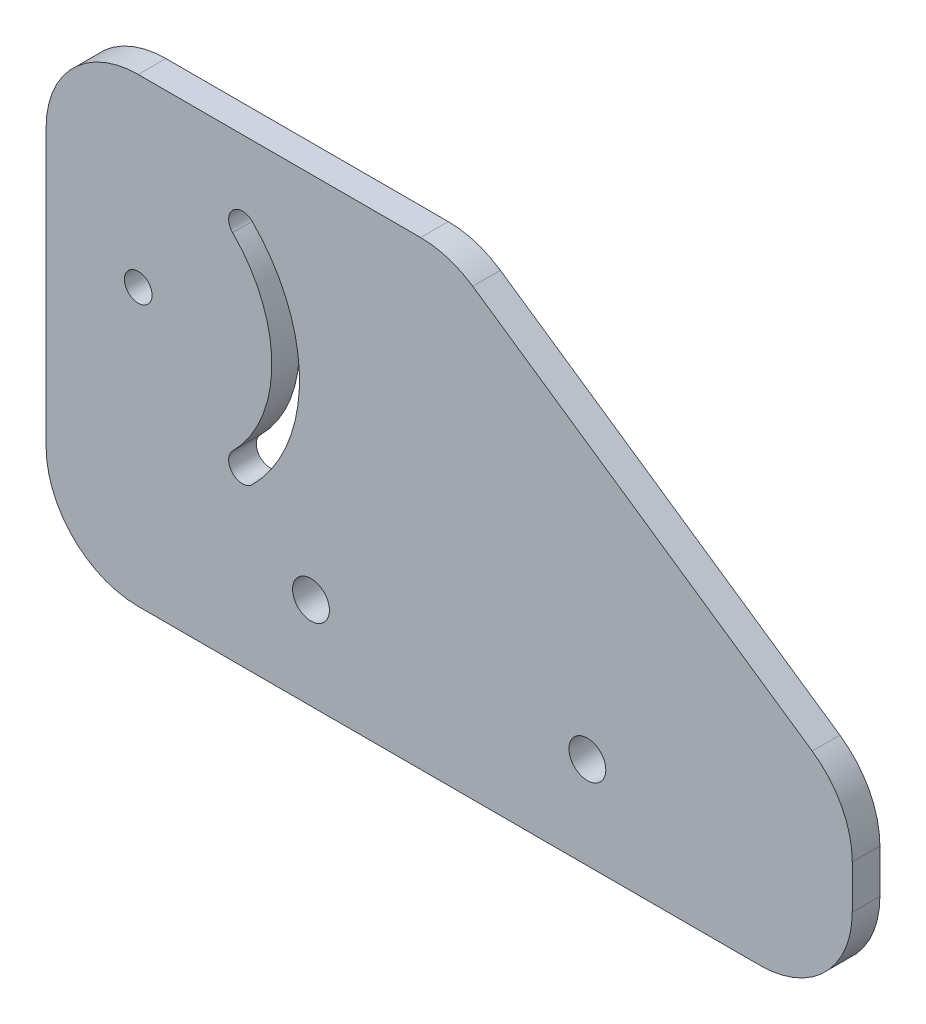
from build123d import *

# Parameters (mm, degrees)
SKETCH_1_W            = 87.5
SKETCH_1_H            = 50
EXTRUDE_1_DEPTH       = 3
HOLE_WIZARD_4_0_4_1_D = 4
CUT_EXTRUDE_2_DEPTH   = 10
SKETCH_6_R            = 1.5
CUT_EXTRUDE_3_DEPTH   = 24
FILLET_1_R            = 10


with BuildPart() as part:
    # Sketch 1 → Extrude 1 (new body)
    with BuildSketch(Plane.XY):
        Rectangle(SKETCH_1_W, SKETCH_1_H)
    extrude(amount=EXTRUDE_1_DEPTH)

    # Hole Wizard 4.0 _4_ _1 (through all)
    with Locations(Plane.XY.offset(3)):
        with Locations((-15, -15), (15, -15)):
            Hole(HOLE_WIZARD_4_0_4_1_D / 2)

    # Sketch 5 → Cut-Extrude 2 (cut)
    with BuildSketch(Plane.XY.offset(3)):
        Polygon((0, 25), (43.75, 25), (43.75, -5), align=None)
    extrude(amount=-CUT_EXTRUDE_2_DEPTH, mode=Mode.SUBTRACT)

    # Sketch 6 → Cut-Extrude 3 (cut)
    with BuildSketch(Plane.XY.offset(3)):
        with Locations((-33.75, 5)):
            Circle(SKETCH_6_R)
        with BuildLine():
            ThreePointArc((-21.375631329, -7.374368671), (-16.25, 5), (-21.375631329, 17.374368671))
            ThreePointArc((-21.375631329, 17.374368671), (-23.496951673, 17.374368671), (-23.496951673, 15.253048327))
            ThreePointArc((-23.496951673, 15.253048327), (-19.25, 5), (-23.496951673, -5.253048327))
            ThreePointArc((-23.496951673, -5.253048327), (-23.496951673, -7.374368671), (-21.375631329, -7.374368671))
        make_face()
    extrude(amount=-CUT_EXTRUDE_3_DEPTH, mode=Mode.SUBTRACT)

    # Fillet 1
    fillet_1_edges = [part.edges().sort_by_distance(p)[0] for p in [
        (43.75, -5, 1.5),
        (0, 25, 1.5),
        (43.75, -25, 1.5),
        (-43.75, -25, 1.5),
        (-43.75, 25, 1.5),
    ]]
    fillet(fillet_1_edges, radius=FILLET_1_R)


solid = part.part
